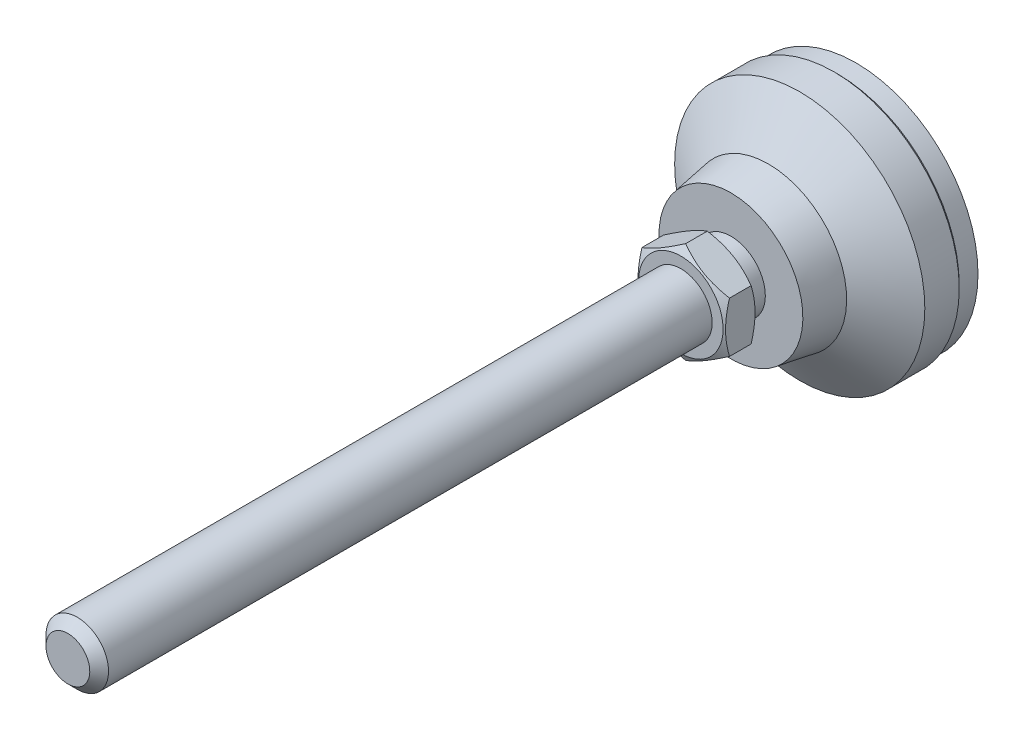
ISO-10303-21;
HEADER;
FILE_DESCRIPTION(('STEP AP214'),'2;1');
FILE_NAME('part.step','',(''),(''),'','','');
FILE_SCHEMA(('AUTOMOTIVE_DESIGN { 1 0 10303 214 1 1 1 1 }'));
ENDSEC;
DATA;
#1=APPLICATION_CONTEXT('core data for automotive mechanical design processes');
#2=APPLICATION_PROTOCOL_DEFINITION('international standard','automotive_design',2000,#1);
#3=PRODUCT_CONTEXT('',#1,'mechanical');
#4=PRODUCT('Part','Part','',(#3));
#5=PRODUCT_RELATED_PRODUCT_CATEGORY('part','',(#4));
#6=PRODUCT_DEFINITION_FORMATION('','',#4);
#7=PRODUCT_DEFINITION_CONTEXT('part definition',#1,'design');
#8=PRODUCT_DEFINITION('design','',#6,#7);
#9=PRODUCT_DEFINITION_SHAPE('','',#8);
#10=(LENGTH_UNIT() NAMED_UNIT(*) SI_UNIT(.MILLI.,.METRE.));
#11=(NAMED_UNIT(*) PLANE_ANGLE_UNIT() SI_UNIT($,.RADIAN.));
#12=(NAMED_UNIT(*) SI_UNIT($,.STERADIAN.) SOLID_ANGLE_UNIT());
#13=UNCERTAINTY_MEASURE_WITH_UNIT(LENGTH_MEASURE(1.E-05),#10,'distance_accuracy_value','');
#14=(GEOMETRIC_REPRESENTATION_CONTEXT(3) GLOBAL_UNCERTAINTY_ASSIGNED_CONTEXT((#13)) GLOBAL_UNIT_ASSIGNED_CONTEXT((#10,
#11,#12)) REPRESENTATION_CONTEXT('',''));
#15=CARTESIAN_POINT('',(0.,0.,0.));
#16=DIRECTION('',(0.,0.,1.));
#17=DIRECTION('',(1.,0.,0.));
#18=AXIS2_PLACEMENT_3D('',#15,#16,#17);
#19=CARTESIAN_POINT('',(0.,0.,1.99999999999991));
#20=DIRECTION('',(0.,0.,-1.));
#21=DIRECTION('',(0.,1.,0.));
#22=AXIS2_PLACEMENT_3D('',#19,#20,#21);
#23=CYLINDRICAL_SURFACE('',#22,20.);
#24=CARTESIAN_POINT('',(0.,0.,3.5));
#25=DIRECTION('',(0.,0.,-1.));
#26=DIRECTION('',(0.,1.,0.));
#27=AXIS2_PLACEMENT_3D('',#24,#25,#26);
#28=CIRCLE('',#27,20.);
#29=CARTESIAN_POINT('',(0.,20.,3.5));
#30=VERTEX_POINT('',#29);
#31=EDGE_CURVE('E114',#30,#30,#28,.F.);
#32=ORIENTED_EDGE('',*,*,#31,.T.);
#33=EDGE_LOOP('',(#32));
#34=FACE_BOUND('',#33,.T.);
#35=CARTESIAN_POINT('',(0.,0.,9.));
#36=DIRECTION('',(0.,0.,-1.));
#37=DIRECTION('',(0.,1.,0.));
#38=AXIS2_PLACEMENT_3D('',#35,#36,#37);
#39=CIRCLE('',#38,20.);
#40=CARTESIAN_POINT('',(0.,20.,9.));
#41=VERTEX_POINT('',#40);
#42=EDGE_CURVE('E108',#41,#41,#39,.T.);
#43=ORIENTED_EDGE('',*,*,#42,.T.);
#44=EDGE_LOOP('',(#43));
#45=FACE_BOUND('',#44,.T.);
#46=ADVANCED_FACE('F14',(#34,#45),#23,.T.);
#47=CARTESIAN_POINT('',(0.,0.,14.));
#48=DIRECTION('',(0.,0.,-1.));
#49=DIRECTION('',(0.,1.,0.));
#50=AXIS2_PLACEMENT_3D('',#47,#48,#49);
#51=CONICAL_SURFACE('',#50,12.5,0.98279372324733);
#52=ORIENTED_EDGE('',*,*,#42,.F.);
#53=EDGE_LOOP('',(#52));
#54=FACE_BOUND('',#53,.T.);
#55=CARTESIAN_POINT('',(0.,0.,14.));
#56=DIRECTION('',(0.,0.,-1.));
#57=DIRECTION('',(0.,1.,0.));
#58=AXIS2_PLACEMENT_3D('',#55,#56,#57);
#59=CIRCLE('',#58,12.5);
#60=CARTESIAN_POINT('',(0.,12.5,14.));
#61=VERTEX_POINT('',#60);
#62=EDGE_CURVE('E105',#61,#61,#59,.T.);
#63=ORIENTED_EDGE('',*,*,#62,.T.);
#64=EDGE_LOOP('',(#63));
#65=FACE_BOUND('',#64,.T.);
#66=ADVANCED_FACE('F226',(#54,#65),#51,.T.);
#67=CARTESIAN_POINT('',(0.,0.,20.));
#68=DIRECTION('',(0.,0.,-1.));
#69=DIRECTION('',(0.,1.,0.));
#70=AXIS2_PLACEMENT_3D('',#67,#68,#69);
#71=CONICAL_SURFACE('',#70,11.5,0.165148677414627);
#72=ORIENTED_EDGE('',*,*,#62,.F.);
#73=EDGE_LOOP('',(#72));
#74=FACE_BOUND('',#73,.T.);
#75=CARTESIAN_POINT('',(0.,0.,20.));
#76=DIRECTION('',(0.,0.,-1.));
#77=DIRECTION('',(0.,1.,0.));
#78=AXIS2_PLACEMENT_3D('',#75,#76,#77);
#79=CIRCLE('',#78,11.5);
#80=CARTESIAN_POINT('',(0.,11.5,20.));
#81=VERTEX_POINT('',#80);
#82=EDGE_CURVE('E102',#81,#81,#79,.T.);
#83=ORIENTED_EDGE('',*,*,#82,.T.);
#84=EDGE_LOOP('',(#83));
#85=FACE_BOUND('',#84,.T.);
#86=ADVANCED_FACE('F222',(#74,#85),#71,.T.);
#87=CARTESIAN_POINT('',(-11.5,0.,20.));
#88=DIRECTION('',(0.,0.,-1.));
#89=DIRECTION('',(0.,1.,0.));
#90=AXIS2_PLACEMENT_3D('',#87,#88,#89);
#91=PLANE('',#90);
#92=ORIENTED_EDGE('',*,*,#82,.F.);
#93=EDGE_LOOP('',(#92));
#94=FACE_BOUND('',#93,.T.);
#95=CARTESIAN_POINT('',(0.,0.,20.));
#96=DIRECTION('',(0.,0.,-1.));
#97=DIRECTION('',(0.,1.,0.));
#98=AXIS2_PLACEMENT_3D('',#95,#96,#97);
#99=CIRCLE('',#98,5.49999999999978);
#100=CARTESIAN_POINT('',(0.,5.49999999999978,20.));
#101=VERTEX_POINT('',#100);
#102=EDGE_CURVE('E99',#101,#101,#99,.T.);
#103=ORIENTED_EDGE('',*,*,#102,.T.);
#104=EDGE_LOOP('',(#103));
#105=FACE_BOUND('',#104,.T.);
#106=ADVANCED_FACE('F218',(#94,#105),#91,.F.);
#107=CARTESIAN_POINT('',(0.,0.,1.99999999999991));
#108=DIRECTION('',(0.,0.,-1.));
#109=DIRECTION('',(0.,1.,0.));
#110=AXIS2_PLACEMENT_3D('',#107,#108,#109);
#111=CYLINDRICAL_SURFACE('',#110,5.49999999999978);
#112=ORIENTED_EDGE('',*,*,#102,.F.);
#113=EDGE_LOOP('',(#112));
#114=FACE_BOUND('',#113,.T.);
#115=CARTESIAN_POINT('',(0.,0.,23.));
#116=DIRECTION('',(0.,0.,-1.));
#117=DIRECTION('',(0.,1.,0.));
#118=AXIS2_PLACEMENT_3D('',#115,#116,#117);
#119=CIRCLE('',#118,5.49999999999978);
#120=CARTESIAN_POINT('',(0.,5.49999999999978,23.));
#121=VERTEX_POINT('',#120);
#122=EDGE_CURVE('E96',#121,#121,#119,.T.);
#123=ORIENTED_EDGE('',*,*,#122,.T.);
#124=EDGE_LOOP('',(#123));
#125=FACE_BOUND('',#124,.T.);
#126=ADVANCED_FACE('F214',(#114,#125),#111,.T.);
#127=CARTESIAN_POINT('',(-5.49999999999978,0.,23.));
#128=DIRECTION('',(0.,0.,1.));
#129=DIRECTION('',(0.,-1.,0.));
#130=AXIS2_PLACEMENT_3D('',#127,#128,#129);
#131=PLANE('',#130);
#132=CARTESIAN_POINT('',(0.,0.,23.));
#133=DIRECTION('',(0.,0.,1.));
#134=DIRECTION('',(0.,-1.,0.));
#135=AXIS2_PLACEMENT_3D('',#132,#133,#134);
#136=CIRCLE('',#135,6.75);
#137=CARTESIAN_POINT('',(0.,-6.75,23.));
#138=VERTEX_POINT('',#137);
#139=EDGE_CURVE('E305',#138,#138,#136,.T.);
#140=ORIENTED_EDGE('',*,*,#139,.F.);
#141=EDGE_LOOP('',(#140));
#142=FACE_BOUND('',#141,.T.);
#143=ORIENTED_EDGE('',*,*,#122,.F.);
#144=EDGE_LOOP('',(#143));
#145=FACE_BOUND('',#144,.T.);
#146=ADVANCED_FACE('F211',(#142,#145),#131,.F.);
#147=CARTESIAN_POINT('',(0.,0.,3.));
#148=DIRECTION('',(0.,0.,1.));
#149=DIRECTION('',(0.,-1.,0.));
#150=AXIS2_PLACEMENT_3D('',#147,#148,#149);
#151=CONICAL_SURFACE('',#150,19.5,0.785398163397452);
#152=ORIENTED_EDGE('',*,*,#31,.F.);
#153=EDGE_LOOP('',(#152));
#154=FACE_BOUND('',#153,.T.);
#155=CARTESIAN_POINT('',(0.,0.,3.));
#156=DIRECTION('',(0.,0.,-1.));
#157=DIRECTION('',(0.,1.,0.));
#158=AXIS2_PLACEMENT_3D('',#155,#156,#157);
#159=CIRCLE('',#158,19.5);
#160=CARTESIAN_POINT('',(0.,19.5,3.));
#161=VERTEX_POINT('',#160);
#162=EDGE_CURVE('E111',#161,#161,#159,.T.);
#163=ORIENTED_EDGE('',*,*,#162,.F.);
#164=EDGE_LOOP('',(#163));
#165=FACE_BOUND('',#164,.T.);
#166=ADVANCED_FACE('F16',(#154,#165),#151,.T.);
#167=CARTESIAN_POINT('',(0.,0.,0.));
#168=DIRECTION('',(0.,0.,1.));
#169=DIRECTION('',(0.,-1.,0.));
#170=AXIS2_PLACEMENT_3D('',#167,#168,#169);
#171=CYLINDRICAL_SURFACE('',#170,19.5);
#172=CARTESIAN_POINT('',(0.,0.,0.));
#173=DIRECTION('',(0.,0.,-1.));
#174=DIRECTION('',(0.,1.,0.));
#175=AXIS2_PLACEMENT_3D('',#172,#173,#174);
#176=CIRCLE('',#175,19.5);
#177=CARTESIAN_POINT('',(0.,19.5,0.));
#178=VERTEX_POINT('',#177);
#179=EDGE_CURVE('E278',#178,#178,#176,.T.);
#180=ORIENTED_EDGE('',*,*,#179,.F.);
#181=EDGE_LOOP('',(#180));
#182=FACE_BOUND('',#181,.T.);
#183=ORIENTED_EDGE('',*,*,#162,.T.);
#184=EDGE_LOOP('',(#183));
#185=FACE_BOUND('',#184,.T.);
#186=ADVANCED_FACE('F251',(#182,#185),#171,.T.);
#187=CARTESIAN_POINT('',(0.,0.,0.));
#188=DIRECTION('',(0.,0.,-1.));
#189=DIRECTION('',(0.,1.,0.));
#190=AXIS2_PLACEMENT_3D('',#187,#188,#189);
#191=PLANE('',#190);
#192=ORIENTED_EDGE('',*,*,#179,.T.);
#193=EDGE_LOOP('',(#192));
#194=FACE_BOUND('',#193,.T.);
#195=ADVANCED_FACE('F134',(#194),#191,.T.);
#196=CARTESIAN_POINT('',(0.,0.,23.));
#197=DIRECTION('',(0.,0.,1.));
#198=DIRECTION('',(0.,-1.,0.));
#199=AXIS2_PLACEMENT_3D('',#196,#197,#198);
#200=CONICAL_SURFACE('',#199,6.75,1.0471975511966);
#201=CARTESIAN_POINT('',(0.000200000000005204,-8.08301923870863,23.7696190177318));
#202=CARTESIAN_POINT('',(-0.153667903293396,-7.99418356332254,23.7183374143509));
#203=CARTESIAN_POINT('',(-0.308109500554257,-7.90501666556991,23.669383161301));
#204=CARTESIAN_POINT('',(-0.618246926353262,-7.72595873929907,23.5767703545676));
#205=CARTESIAN_POINT('',(-0.773943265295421,-7.63606741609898,23.5331140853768));
#206=CARTESIAN_POINT('',(-1.24352516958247,-7.36495417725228,23.4109491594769));
#207=CARTESIAN_POINT('',(-1.55926433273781,-7.18266208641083,23.3414631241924));
#208=CARTESIAN_POINT('',(-2.03176224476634,-6.90986528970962,23.2599825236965));
#209=CARTESIAN_POINT('',(-2.1871092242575,-6.82017566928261,23.2367710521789));
#210=CARTESIAN_POINT('',(-2.49850511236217,-6.64039116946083,23.1978487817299));
#211=CARTESIAN_POINT('',(-2.65455395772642,-6.55029632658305,23.1821373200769));
#212=CARTESIAN_POINT('',(-2.96692267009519,-6.36995016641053,23.1586154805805));
#213=CARTESIAN_POINT('',(-3.12324202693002,-6.27969914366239,23.1507961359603));
#214=CARTESIAN_POINT('',(-3.43601650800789,-6.09911871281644,23.1432178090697));
#215=CARTESIAN_POINT('',(-3.59247162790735,-6.00878930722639,23.1434585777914));
#216=CARTESIAN_POINT('',(-4.02110687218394,-5.76131663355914,23.1551972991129));
#217=CARTESIAN_POINT('',(-4.2931466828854,-5.60425437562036,23.1749033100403));
#218=CARTESIAN_POINT('',(-4.83541944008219,-5.29117305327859,23.2373910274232));
#219=CARTESIAN_POINT('',(-5.10565047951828,-5.13515508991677,23.2801940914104));
#220=CARTESIAN_POINT('',(-5.64901454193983,-4.82144370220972,23.3871892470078));
#221=CARTESIAN_POINT('',(-5.92207900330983,-4.66378986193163,23.4518346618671));
#222=CARTESIAN_POINT('',(-6.46413578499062,-4.35083323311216,23.5985536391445));
#223=CARTESIAN_POINT('',(-6.73313504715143,-4.19552643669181,23.680592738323));
#224=CARTESIAN_POINT('',(-7.0002,-4.04133641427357,23.7696190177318));
#225=B_SPLINE_CURVE_WITH_KNOTS('',3,(#201,#202,#203,#204,#205,#206,#207,#208,#209,#210,#211,
#212,#213,#214,#215,#216,#217,#218,#219,#220,#221,#222,#223,#224),.UNSPECIFIED.,.F.,.F.,(4,2,2,
2,2,2,2,2,2,2,2,4),(0.,0.554727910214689,1.10969417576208,2.2219327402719,2.76443041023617,
3.30688013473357,3.8487128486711,4.39052882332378,5.33376515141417,6.27787517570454,
7.24292418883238,8.20607866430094),.UNSPECIFIED.);
#226=CARTESIAN_POINT('',(0.,-8.08290376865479,23.7695523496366));
#227=VERTEX_POINT('',#226);
#228=CARTESIAN_POINT('',(-7.,-4.04145188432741,23.7695523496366));
#229=VERTEX_POINT('',#228);
#230=EDGE_CURVE('E73',#227,#229,#225,.T.);
#231=ORIENTED_EDGE('',*,*,#230,.T.);
#232=CARTESIAN_POINT('',(-7.,10.8744224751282,26.5695463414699));
#233=CARTESIAN_POINT('',(-7.,10.5685293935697,26.4210861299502));
#234=CARTESIAN_POINT('',(-7.,10.2619361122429,26.2740440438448));
#235=CARTESIAN_POINT('',(-7.,9.64697684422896,25.9835933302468));
#236=CARTESIAN_POINT('',(-7.,9.33861058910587,25.8401852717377));
#237=CARTESIAN_POINT('',(-7.,8.71815320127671,25.5570823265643));
#238=CARTESIAN_POINT('',(-7.,8.40605094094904,25.4174117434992));
#239=CARTESIAN_POINT('',(-7.,7.77937061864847,25.1437615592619));
#240=CARTESIAN_POINT('',(-7.,7.46479267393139,25.0097816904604));
#241=CARTESIAN_POINT('',(-7.,6.82243612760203,24.7447970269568));
#242=CARTESIAN_POINT('',(-7.,6.49455954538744,24.6140284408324));
#243=CARTESIAN_POINT('',(-7.,5.83497811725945,24.3623433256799));
#244=CARTESIAN_POINT('',(-7.,5.50327284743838,24.241427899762));
#245=CARTESIAN_POINT('',(-7.,4.83611715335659,24.0126100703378));
#246=CARTESIAN_POINT('',(-7.,4.50067580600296,23.9046814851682));
#247=CARTESIAN_POINT('',(-7.,3.82499332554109,23.7052869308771));
#248=CARTESIAN_POINT('',(-7.,3.48475373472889,23.6138157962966));
#249=CARTESIAN_POINT('',(-7.,2.80111690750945,23.4522069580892));
#250=CARTESIAN_POINT('',(-7.,2.45774793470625,23.3819529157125));
#251=CARTESIAN_POINT('',(-7.,1.9395523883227,23.2955166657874));
#252=CARTESIAN_POINT('',(-7.,1.76628408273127,23.269860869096));
#253=CARTESIAN_POINT('',(-7.,1.41888071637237,23.2253671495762));
#254=CARTESIAN_POINT('',(-7.,1.2447457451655,23.2065285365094));
#255=CARTESIAN_POINT('',(-7.,0.898124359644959,23.1762815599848));
#256=CARTESIAN_POINT('',(-7.,0.725646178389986,23.1647792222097));
#257=CARTESIAN_POINT('',(-7.,0.380357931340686,23.1490795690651));
#258=CARTESIAN_POINT('',(-7.,0.20754787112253,23.1448821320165));
#259=CARTESIAN_POINT('',(-7.,-0.138095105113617,23.1438924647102));
#260=CARTESIAN_POINT('',(-7.,-0.310928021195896,23.1471002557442));
#261=CARTESIAN_POINT('',(-7.,-0.656304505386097,23.1608423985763));
#262=CARTESIAN_POINT('',(-7.,-0.828848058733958,23.1713771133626));
#263=CARTESIAN_POINT('',(-7.,-1.24295519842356,23.2052297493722));
#264=CARTESIAN_POINT('',(-7.,-1.48424316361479,23.2319925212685));
#265=CARTESIAN_POINT('',(-7.,-1.96502916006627,23.2983905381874));
#266=CARTESIAN_POINT('',(-7.,-2.20452694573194,23.3380275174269));
#267=CARTESIAN_POINT('',(-7.,-2.92006051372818,23.4741481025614));
#268=CARTESIAN_POINT('',(-7.,-3.3928703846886,23.5878167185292));
#269=CARTESIAN_POINT('',(-7.,-4.09987706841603,23.7849469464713));
#270=CARTESIAN_POINT('',(-7.,-4.33774042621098,23.8560149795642));
#271=CARTESIAN_POINT('',(-7.,-4.81115690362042,24.0055374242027));
#272=CARTESIAN_POINT('',(-7.,-5.04671000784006,24.0839918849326));
#273=CARTESIAN_POINT('',(-7.,-5.51558001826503,24.2470279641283));
#274=CARTESIAN_POINT('',(-7.,-5.74889763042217,24.3316075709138));
#275=CARTESIAN_POINT('',(-7.,-6.21359932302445,24.5058982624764));
#276=CARTESIAN_POINT('',(-7.,-6.44498342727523,24.5956092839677));
#277=CARTESIAN_POINT('',(-7.,-6.99564532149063,24.8150159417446));
#278=CARTESIAN_POINT('',(-7.,-7.31412949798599,24.9466998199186));
#279=CARTESIAN_POINT('',(-7.,-7.94835141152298,25.216542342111));
#280=CARTESIAN_POINT('',(-7.,-8.26408897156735,25.3547013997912));
#281=CARTESIAN_POINT('',(-7.,-8.89332991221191,25.6361787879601));
#282=CARTESIAN_POINT('',(-7.,-9.2068328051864,25.7794982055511));
#283=CARTESIAN_POINT('',(-7.,-9.83192836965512,26.07025140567));
#284=CARTESIAN_POINT('',(-7.,-10.1435209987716,26.217685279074));
#285=CARTESIAN_POINT('',(-7.,-10.765449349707,26.5160481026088));
#286=CARTESIAN_POINT('',(-7.,-11.0757833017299,26.6669807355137));
#287=CARTESIAN_POINT('',(-7.,-11.6951055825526,26.9715845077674));
#288=CARTESIAN_POINT('',(-7.,-12.0040938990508,27.1252556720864));
#289=CARTESIAN_POINT('',(-7.,-12.9292795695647,27.5895982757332));
#290=CARTESIAN_POINT('',(-7.,-13.543784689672,27.9036409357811));
#291=CARTESIAN_POINT('',(-7.,-14.7172311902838,28.5109598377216));
#292=CARTESIAN_POINT('',(-7.,-15.2764399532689,28.8037217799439));
#293=CARTESIAN_POINT('',(-7.,-16.392787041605,29.393213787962));
#294=CARTESIAN_POINT('',(-7.,-16.9499252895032,29.6899440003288));
#295=CARTESIAN_POINT('',(-7.,-18.0611636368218,30.2856562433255));
#296=CARTESIAN_POINT('',(-7.,-18.6152678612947,30.5846305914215));
#297=CARTESIAN_POINT('',(-7.,-19.7221554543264,31.1849408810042));
#298=CARTESIAN_POINT('',(-7.,-20.2749388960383,31.4862766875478));
#299=CARTESIAN_POINT('',(-7.,-20.8272377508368,31.7884921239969));
#300=B_SPLINE_CURVE_WITH_KNOTS('',3,(#232,#233,#234,#235,#236,#237,#238,#239,#240,#241,#242,
#243,#244,#245,#246,#247,#248,#249,#250,#251,#252,#253,#254,#255,#256,#257,#258,#259,#260,#261,
#262,#263,#264,#265,#266,#267,#268,#269,#270,#271,#272,#273,#274,#275,#276,#277,#278,#279,#280,
#281,#282,#283,#284,#285,#286,#287,#288,#289,#290,#291,#292,#293,#294,#295,#296,#297,#298,#299),
.UNSPECIFIED.,.F.,.F.,(4,2,2,2,2,2,2,2,2,2,2,2,2,2,2,2,2,2,2,2,2,2,2,2,2,2,2,2,2,2,2,2,2,4),(0.,
1.0200609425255,2.04028062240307,3.06602318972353,4.09171746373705,5.15057109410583,
6.20954310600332,7.26634311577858,8.32281084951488,9.37337588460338,9.89873518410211,
10.424041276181,10.9424756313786,11.4609013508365,11.9793285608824,12.4977814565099,
13.2256734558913,13.9536635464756,15.4104419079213,16.1551391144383,16.8998412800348,
17.6442999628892,18.3887494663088,19.4225551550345,20.4564269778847,21.4905178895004,
22.5246316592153,23.5598883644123,24.5951545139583,26.6653967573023,28.5590049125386,
30.4526832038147,32.341527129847,34.2302638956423),.UNSPECIFIED.);
#301=CARTESIAN_POINT('',(-7.,4.04145188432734,23.7695523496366));
#302=VERTEX_POINT('',#301);
#303=EDGE_CURVE('E81',#229,#302,#300,.F.);
#304=ORIENTED_EDGE('',*,*,#303,.T.);
#305=CARTESIAN_POINT('',(-7.0002,4.0413364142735,23.7696190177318));
#306=CARTESIAN_POINT('',(-6.8463320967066,4.13017208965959,23.7183374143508));
#307=CARTESIAN_POINT('',(-6.69189049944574,4.21933898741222,23.669383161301));
#308=CARTESIAN_POINT('',(-6.38175307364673,4.39839691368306,23.5767703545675));
#309=CARTESIAN_POINT('',(-6.22605673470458,4.48828823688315,23.5331140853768));
#310=CARTESIAN_POINT('',(-5.75647483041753,4.75940147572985,23.4109491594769));
#311=CARTESIAN_POINT('',(-5.4407356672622,4.94169356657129,23.3414631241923));
#312=CARTESIAN_POINT('',(-4.96823775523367,5.2144903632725,23.2599825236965));
#313=CARTESIAN_POINT('',(-4.81289077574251,5.30417998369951,23.2367710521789));
#314=CARTESIAN_POINT('',(-4.50149488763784,5.48396448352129,23.1978487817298));
#315=CARTESIAN_POINT('',(-4.34544604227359,5.57405932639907,23.1821373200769));
#316=CARTESIAN_POINT('',(-4.03307732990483,5.75440548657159,23.1586154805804));
#317=CARTESIAN_POINT('',(-3.87675797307,5.84465650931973,23.1507961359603));
#318=CARTESIAN_POINT('',(-3.56398349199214,6.02523694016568,23.1432178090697));
#319=CARTESIAN_POINT('',(-3.40752837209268,6.11556634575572,23.1434585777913));
#320=CARTESIAN_POINT('',(-2.97889312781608,6.36303901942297,23.1551972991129));
#321=CARTESIAN_POINT('',(-2.70685331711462,6.52010127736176,23.1749033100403));
#322=CARTESIAN_POINT('',(-2.16458055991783,6.83318259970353,23.2373910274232));
#323=CARTESIAN_POINT('',(-1.89434952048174,6.98920056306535,23.2801940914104));
#324=CARTESIAN_POINT('',(-1.35098545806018,7.3029119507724,23.3871892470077));
#325=CARTESIAN_POINT('',(-1.07792099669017,7.4605657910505,23.4518346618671));
#326=CARTESIAN_POINT('',(-0.535864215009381,7.77352241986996,23.5985536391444));
#327=CARTESIAN_POINT('',(-0.266864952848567,7.92882921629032,23.6805927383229));
#328=CARTESIAN_POINT('',(0.000200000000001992,8.08301923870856,23.7696190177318));
#329=B_SPLINE_CURVE_WITH_KNOTS('',3,(#305,#306,#307,#308,#309,#310,#311,#312,#313,#314,#315,
#316,#317,#318,#319,#320,#321,#322,#323,#324,#325,#326,#327,#328),.UNSPECIFIED.,.F.,.F.,(4,2,2,
2,2,2,2,2,2,2,2,4),(0.,0.554727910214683,1.10969417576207,2.22193274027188,2.76443041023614,
3.30688013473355,3.84871284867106,4.39052882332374,5.33376515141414,6.27787517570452,
7.24292418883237,8.20607866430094),.UNSPECIFIED.);
#330=CARTESIAN_POINT('',(0.,8.08290376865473,23.7695523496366));
#331=VERTEX_POINT('',#330);
#332=EDGE_CURVE('E193',#302,#331,#329,.T.);
#333=ORIENTED_EDGE('',*,*,#332,.T.);
#334=CARTESIAN_POINT('',(-0.000199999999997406,8.08301923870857,23.7696190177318));
#335=CARTESIAN_POINT('',(0.153667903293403,7.99418356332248,23.7183374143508));
#336=CARTESIAN_POINT('',(0.308109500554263,7.90501666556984,23.669383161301));
#337=CARTESIAN_POINT('',(0.618246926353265,7.72595873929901,23.5767703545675));
#338=CARTESIAN_POINT('',(0.773943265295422,7.63606741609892,23.5331140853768));
#339=CARTESIAN_POINT('',(1.24352516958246,7.36495417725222,23.4109491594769));
#340=CARTESIAN_POINT('',(1.5592643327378,7.18266208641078,23.3414631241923));
#341=CARTESIAN_POINT('',(2.03176224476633,6.90986528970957,23.2599825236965));
#342=CARTESIAN_POINT('',(2.18710922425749,6.82017566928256,23.2367710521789));
#343=CARTESIAN_POINT('',(2.49850511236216,6.64039116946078,23.1978487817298));
#344=CARTESIAN_POINT('',(2.65455395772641,6.550296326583,23.1821373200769));
#345=CARTESIAN_POINT('',(2.96692267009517,6.36995016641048,23.1586154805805));
#346=CARTESIAN_POINT('',(3.12324202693,6.27969914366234,23.1507961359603));
#347=CARTESIAN_POINT('',(3.43601650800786,6.09911871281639,23.1432178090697));
#348=CARTESIAN_POINT('',(3.59247162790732,6.00878930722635,23.1434585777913));
#349=CARTESIAN_POINT('',(4.02110687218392,5.7613166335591,23.1551972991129));
#350=CARTESIAN_POINT('',(4.29314668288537,5.60425437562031,23.1749033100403));
#351=CARTESIAN_POINT('',(4.83541944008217,5.29117305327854,23.2373910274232));
#352=CARTESIAN_POINT('',(5.10565047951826,5.13515508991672,23.2801940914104));
#353=CARTESIAN_POINT('',(5.64901454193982,4.82144370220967,23.3871892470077));
#354=CARTESIAN_POINT('',(5.92207900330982,4.66378986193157,23.4518346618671));
#355=CARTESIAN_POINT('',(6.46413578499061,4.35083323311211,23.5985536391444));
#356=CARTESIAN_POINT('',(6.73313504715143,4.19552643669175,23.6805927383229));
#357=CARTESIAN_POINT('',(7.0002,4.04133641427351,23.7696190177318));
#358=B_SPLINE_CURVE_WITH_KNOTS('',3,(#334,#335,#336,#337,#338,#339,#340,#341,#342,#343,#344,
#345,#346,#347,#348,#349,#350,#351,#352,#353,#354,#355,#356,#357),.UNSPECIFIED.,.F.,.F.,(4,2,2,
2,2,2,2,2,2,2,2,4),(0.,0.554727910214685,1.10969417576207,2.22193274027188,2.76443041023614,
3.30688013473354,3.84871284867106,4.39052882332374,5.33376515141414,6.27787517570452,
7.24292418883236,8.20607866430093),.UNSPECIFIED.);
#359=CARTESIAN_POINT('',(7.,4.04145188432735,23.7695523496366));
#360=VERTEX_POINT('',#359);
#361=EDGE_CURVE('E304',#331,#360,#358,.T.);
#362=ORIENTED_EDGE('',*,*,#361,.T.);
#363=CARTESIAN_POINT('',(7.,10.8744224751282,26.5695463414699));
#364=CARTESIAN_POINT('',(7.,10.5685293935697,26.4210861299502));
#365=CARTESIAN_POINT('',(7.,10.2619361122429,26.2740440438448));
#366=CARTESIAN_POINT('',(7.,9.64697684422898,25.9835933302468));
#367=CARTESIAN_POINT('',(7.,9.33861058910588,25.8401852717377));
#368=CARTESIAN_POINT('',(7.,8.71815320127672,25.5570823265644));
#369=CARTESIAN_POINT('',(7.,8.40605094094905,25.4174117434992));
#370=CARTESIAN_POINT('',(7.,7.77937061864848,25.1437615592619));
#371=CARTESIAN_POINT('',(7.,7.4647926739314,25.0097816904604));
#372=CARTESIAN_POINT('',(7.,6.82243612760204,24.7447970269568));
#373=CARTESIAN_POINT('',(7.,6.49455954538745,24.6140284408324));
#374=CARTESIAN_POINT('',(7.,5.83497811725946,24.3623433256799));
#375=CARTESIAN_POINT('',(7.,5.50327284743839,24.241427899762));
#376=CARTESIAN_POINT('',(7.,4.8361171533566,24.0126100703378));
#377=CARTESIAN_POINT('',(7.,4.50067580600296,23.9046814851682));
#378=CARTESIAN_POINT('',(7.,3.82499332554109,23.7052869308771));
#379=CARTESIAN_POINT('',(7.,3.48475373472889,23.6138157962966));
#380=CARTESIAN_POINT('',(7.,2.80111690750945,23.4522069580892));
#381=CARTESIAN_POINT('',(7.,2.45774793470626,23.3819529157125));
#382=CARTESIAN_POINT('',(7.,1.9395523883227,23.2955166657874));
#383=CARTESIAN_POINT('',(7.,1.76628408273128,23.269860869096));
#384=CARTESIAN_POINT('',(7.,1.41888071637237,23.2253671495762));
#385=CARTESIAN_POINT('',(7.,1.24474574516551,23.2065285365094));
#386=CARTESIAN_POINT('',(7.,0.898124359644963,23.1762815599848));
#387=CARTESIAN_POINT('',(7.,0.72564617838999,23.1647792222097));
#388=CARTESIAN_POINT('',(7.,0.380357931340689,23.1490795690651));
#389=CARTESIAN_POINT('',(7.,0.207547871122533,23.1448821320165));
#390=CARTESIAN_POINT('',(7.,-0.138095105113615,23.1438924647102));
#391=CARTESIAN_POINT('',(7.,-0.310928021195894,23.1471002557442));
#392=CARTESIAN_POINT('',(7.,-0.656304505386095,23.1608423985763));
#393=CARTESIAN_POINT('',(7.,-0.828848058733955,23.1713771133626));
#394=CARTESIAN_POINT('',(7.,-1.24295519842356,23.2052297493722));
#395=CARTESIAN_POINT('',(7.,-1.48424316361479,23.2319925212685));
#396=CARTESIAN_POINT('',(7.,-1.96502916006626,23.2983905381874));
#397=CARTESIAN_POINT('',(7.,-2.20452694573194,23.3380275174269));
#398=CARTESIAN_POINT('',(7.,-2.92006051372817,23.4741481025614));
#399=CARTESIAN_POINT('',(7.,-3.3928703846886,23.5878167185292));
#400=CARTESIAN_POINT('',(7.,-4.09987706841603,23.7849469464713));
#401=CARTESIAN_POINT('',(7.,-4.33774042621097,23.8560149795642));
#402=CARTESIAN_POINT('',(7.,-4.81115690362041,24.0055374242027));
#403=CARTESIAN_POINT('',(7.,-5.04671000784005,24.0839918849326));
#404=CARTESIAN_POINT('',(7.,-5.51558001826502,24.2470279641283));
#405=CARTESIAN_POINT('',(7.,-5.74889763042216,24.3316075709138));
#406=CARTESIAN_POINT('',(7.,-6.21359932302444,24.5058982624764));
#407=CARTESIAN_POINT('',(7.,-6.44498342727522,24.5956092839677));
#408=CARTESIAN_POINT('',(7.,-6.99564532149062,24.8150159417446));
#409=CARTESIAN_POINT('',(7.,-7.31412949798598,24.9466998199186));
#410=CARTESIAN_POINT('',(7.,-7.94835141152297,25.216542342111));
#411=CARTESIAN_POINT('',(7.,-8.26408897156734,25.3547013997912));
#412=CARTESIAN_POINT('',(7.,-8.8933299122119,25.6361787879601));
#413=CARTESIAN_POINT('',(7.,-9.2068328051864,25.7794982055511));
#414=CARTESIAN_POINT('',(7.,-9.83192836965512,26.07025140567));
#415=CARTESIAN_POINT('',(7.,-10.1435209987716,26.217685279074));
#416=CARTESIAN_POINT('',(7.,-10.765449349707,26.5160481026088));
#417=CARTESIAN_POINT('',(7.,-11.0757833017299,26.6669807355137));
#418=CARTESIAN_POINT('',(7.,-11.6951055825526,26.9715845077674));
#419=CARTESIAN_POINT('',(7.,-12.0040938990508,27.1252556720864));
#420=CARTESIAN_POINT('',(7.,-12.9292795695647,27.5895982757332));
#421=CARTESIAN_POINT('',(7.,-13.543784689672,27.9036409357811));
#422=CARTESIAN_POINT('',(7.,-14.7172311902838,28.5109598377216));
#423=CARTESIAN_POINT('',(7.,-15.2764399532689,28.8037217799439));
#424=CARTESIAN_POINT('',(7.,-16.392787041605,29.3932137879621));
#425=CARTESIAN_POINT('',(7.,-16.9499252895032,29.6899440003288));
#426=CARTESIAN_POINT('',(7.,-18.0611636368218,30.2856562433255));
#427=CARTESIAN_POINT('',(7.,-18.6152678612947,30.5846305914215));
#428=CARTESIAN_POINT('',(7.,-19.7221554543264,31.1849408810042));
#429=CARTESIAN_POINT('',(7.,-20.2749388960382,31.4862766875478));
#430=CARTESIAN_POINT('',(7.,-20.8272377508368,31.7884921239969));
#431=B_SPLINE_CURVE_WITH_KNOTS('',3,(#363,#364,#365,#366,#367,#368,#369,#370,#371,#372,#373,
#374,#375,#376,#377,#378,#379,#380,#381,#382,#383,#384,#385,#386,#387,#388,#389,#390,#391,#392,
#393,#394,#395,#396,#397,#398,#399,#400,#401,#402,#403,#404,#405,#406,#407,#408,#409,#410,#411,
#412,#413,#414,#415,#416,#417,#418,#419,#420,#421,#422,#423,#424,#425,#426,#427,#428,#429,#430),
.UNSPECIFIED.,.F.,.F.,(4,2,2,2,2,2,2,2,2,2,2,2,2,2,2,2,2,2,2,2,2,2,2,2,2,2,2,2,2,2,2,2,2,4),(0.,
1.0200609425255,2.04028062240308,3.06602318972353,4.09171746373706,5.15057109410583,
6.20954310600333,7.26634311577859,8.32281084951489,9.37337588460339,9.89873518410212,
10.4240412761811,10.9424756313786,11.4609013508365,11.9793285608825,12.4977814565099,
13.2256734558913,13.9536635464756,15.4104419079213,16.1551391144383,16.8998412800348,
17.6442999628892,18.3887494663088,19.4225551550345,20.4564269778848,21.4905178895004,
22.5246316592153,23.5598883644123,24.5951545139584,26.6653967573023,28.5590049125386,
30.4526832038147,32.3415271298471,34.2302638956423),.UNSPECIFIED.);
#432=CARTESIAN_POINT('',(7.,-4.04145188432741,23.7695523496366));
#433=VERTEX_POINT('',#432);
#434=EDGE_CURVE('E34',#360,#433,#431,.T.);
#435=ORIENTED_EDGE('',*,*,#434,.T.);
#436=CARTESIAN_POINT('',(7.0002,-4.04133641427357,23.7696190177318));
#437=CARTESIAN_POINT('',(6.8463320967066,-4.13017208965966,23.7183374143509));
#438=CARTESIAN_POINT('',(6.69189049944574,-4.2193389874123,23.669383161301));
#439=CARTESIAN_POINT('',(6.38175307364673,-4.39839691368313,23.5767703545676));
#440=CARTESIAN_POINT('',(6.22605673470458,-4.48828823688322,23.5331140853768));
#441=CARTESIAN_POINT('',(5.75647483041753,-4.75940147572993,23.4109491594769));
#442=CARTESIAN_POINT('',(5.44073566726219,-4.94169356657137,23.3414631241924));
#443=CARTESIAN_POINT('',(4.96823775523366,-5.21449036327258,23.2599825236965));
#444=CARTESIAN_POINT('',(4.8128907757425,-5.30417998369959,23.2367710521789));
#445=CARTESIAN_POINT('',(4.50149488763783,-5.48396448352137,23.1978487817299));
#446=CARTESIAN_POINT('',(4.34544604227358,-5.57405932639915,23.1821373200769));
#447=CARTESIAN_POINT('',(4.03307732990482,-5.75440548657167,23.1586154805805));
#448=CARTESIAN_POINT('',(3.87675797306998,-5.84465650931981,23.1507961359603));
#449=CARTESIAN_POINT('',(3.56398349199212,-6.02523694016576,23.1432178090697));
#450=CARTESIAN_POINT('',(3.40752837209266,-6.11556634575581,23.1434585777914));
#451=CARTESIAN_POINT('',(2.97889312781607,-6.36303901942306,23.1551972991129));
#452=CARTESIAN_POINT('',(2.70685331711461,-6.52010127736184,23.1749033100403));
#453=CARTESIAN_POINT('',(2.16458055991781,-6.83318259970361,23.2373910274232));
#454=CARTESIAN_POINT('',(1.89434952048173,-6.98920056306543,23.2801940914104));
#455=CARTESIAN_POINT('',(1.35098545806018,-7.30291195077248,23.3871892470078));
#456=CARTESIAN_POINT('',(1.07792099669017,-7.46056579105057,23.4518346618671));
#457=CARTESIAN_POINT('',(0.535864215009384,-7.77352241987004,23.5985536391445));
#458=CARTESIAN_POINT('',(0.266864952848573,-7.92882921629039,23.680592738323));
#459=CARTESIAN_POINT('',(-0.000199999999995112,-8.08301923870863,23.7696190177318));
#460=B_SPLINE_CURVE_WITH_KNOTS('',3,(#436,#437,#438,#439,#440,#441,#442,#443,#444,#445,#446,
#447,#448,#449,#450,#451,#452,#453,#454,#455,#456,#457,#458,#459),.UNSPECIFIED.,.F.,.F.,(4,2,2,
2,2,2,2,2,2,2,2,4),(0.,0.554727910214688,1.10969417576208,2.22193274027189,2.76443041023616,
3.30688013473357,3.84871284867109,4.39052882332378,5.33376515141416,6.27787517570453,
7.24292418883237,8.20607866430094),.UNSPECIFIED.);
#461=EDGE_CURVE('E9',#433,#227,#460,.T.);
#462=ORIENTED_EDGE('',*,*,#461,.T.);
#463=EDGE_LOOP('',(#231,#304,#333,#362,#435,#462));
#464=FACE_BOUND('',#463,.T.);
#465=ORIENTED_EDGE('',*,*,#139,.T.);
#466=EDGE_LOOP('',(#465));
#467=FACE_BOUND('',#466,.T.);
#468=ADVANCED_FACE('F71',(#464,#467),#200,.T.);
#469=CARTESIAN_POINT('',(0.,0.,126.));
#470=DIRECTION('',(0.,0.,-1.));
#471=DIRECTION('',(0.,1.,0.));
#472=AXIS2_PLACEMENT_3D('',#469,#470,#471);
#473=PLANE('',#472);
#474=CARTESIAN_POINT('',(0.,0.,126.));
#475=DIRECTION('',(0.,0.,-1.));
#476=DIRECTION('',(0.,1.,0.));
#477=AXIS2_PLACEMENT_3D('',#474,#475,#476);
#478=CIRCLE('',#477,3.5);
#479=CARTESIAN_POINT('',(0.,3.5,126.));
#480=VERTEX_POINT('',#479);
#481=EDGE_CURVE('E87',#480,#480,#478,.T.);
#482=ORIENTED_EDGE('',*,*,#481,.F.);
#483=EDGE_LOOP('',(#482));
#484=FACE_BOUND('',#483,.T.);
#485=ADVANCED_FACE('F183',(#484),#473,.F.);
#486=CARTESIAN_POINT('',(0.,0.,126.));
#487=DIRECTION('',(0.,0.,-1.));
#488=DIRECTION('',(0.,1.,0.));
#489=AXIS2_PLACEMENT_3D('',#486,#487,#488);
#490=CONICAL_SURFACE('',#489,3.5,0.785398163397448);
#491=CARTESIAN_POINT('',(0.,0.,124.5));
#492=DIRECTION('',(0.,0.,-1.));
#493=DIRECTION('',(0.,1.,0.));
#494=AXIS2_PLACEMENT_3D('',#491,#492,#493);
#495=CIRCLE('',#494,5.);
#496=CARTESIAN_POINT('',(0.,5.,124.5));
#497=VERTEX_POINT('',#496);
#498=EDGE_CURVE('E92',#497,#497,#495,.T.);
#499=ORIENTED_EDGE('',*,*,#498,.F.);
#500=EDGE_LOOP('',(#499));
#501=FACE_BOUND('',#500,.T.);
#502=ORIENTED_EDGE('',*,*,#481,.T.);
#503=EDGE_LOOP('',(#502));
#504=FACE_BOUND('',#503,.T.);
#505=ADVANCED_FACE('F264',(#501,#504),#490,.T.);
#506=CARTESIAN_POINT('',(0.,0.,-4.74975615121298));
#507=DIRECTION('',(0.,0.,-1.));
#508=DIRECTION('',(0.,1.,0.));
#509=AXIS2_PLACEMENT_3D('',#506,#507,#508);
#510=CYLINDRICAL_SURFACE('',#509,5.);
#511=CARTESIAN_POINT('',(0.,0.,28.));
#512=DIRECTION('',(0.,0.,-1.));
#513=DIRECTION('',(0.,1.,0.));
#514=AXIS2_PLACEMENT_3D('',#511,#512,#513);
#515=CIRCLE('',#514,5.);
#516=CARTESIAN_POINT('',(0.,5.,28.));
#517=VERTEX_POINT('',#516);
#518=EDGE_CURVE('E117',#517,#517,#515,.F.);
#519=ORIENTED_EDGE('',*,*,#518,.T.);
#520=EDGE_LOOP('',(#519));
#521=FACE_BOUND('',#520,.T.);
#522=ORIENTED_EDGE('',*,*,#498,.T.);
#523=EDGE_LOOP('',(#522));
#524=FACE_BOUND('',#523,.T.);
#525=ADVANCED_FACE('F209',(#521,#524),#510,.T.);
#526=CARTESIAN_POINT('',(-3.99999999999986,0.,28.));
#527=DIRECTION('',(0.,0.,-1.));
#528=DIRECTION('',(0.,1.,0.));
#529=AXIS2_PLACEMENT_3D('',#526,#527,#528);
#530=PLANE('',#529);
#531=CARTESIAN_POINT('',(0.,0.,28.));
#532=DIRECTION('',(0.,0.,1.));
#533=DIRECTION('',(0.,-1.,0.));
#534=AXIS2_PLACEMENT_3D('',#531,#532,#533);
#535=CIRCLE('',#534,6.75);
#536=CARTESIAN_POINT('',(0.,-6.75,28.));
#537=VERTEX_POINT('',#536);
#538=EDGE_CURVE('E80',#537,#537,#535,.T.);
#539=ORIENTED_EDGE('',*,*,#538,.T.);
#540=EDGE_LOOP('',(#539));
#541=FACE_BOUND('',#540,.T.);
#542=ORIENTED_EDGE('',*,*,#518,.F.);
#543=EDGE_LOOP('',(#542));
#544=FACE_BOUND('',#543,.T.);
#545=ADVANCED_FACE('F131',(#541,#544),#530,.F.);
#546=CARTESIAN_POINT('',(0.,0.,25.9677582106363));
#547=DIRECTION('',(0.,0.,-1.));
#548=DIRECTION('',(0.,1.,0.));
#549=AXIS2_PLACEMENT_3D('',#546,#547,#548);
#550=CONICAL_SURFACE('',#549,10.2699460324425,1.0471975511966);
#551=CARTESIAN_POINT('',(-7.0002,-4.04133641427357,27.230380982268));
#552=CARTESIAN_POINT('',(-6.84633209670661,-4.13017208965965,27.281662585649));
#553=CARTESIAN_POINT('',(-6.69189049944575,-4.21933898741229,27.3306168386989));
#554=CARTESIAN_POINT('',(-6.38175307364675,-4.39839691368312,27.4232296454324));
#555=CARTESIAN_POINT('',(-6.22605673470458,-4.48828823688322,27.4668859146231));
#556=CARTESIAN_POINT('',(-5.75647483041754,-4.75940147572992,27.589050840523));
#557=CARTESIAN_POINT('',(-5.4407356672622,-4.94169356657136,27.6585368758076));
#558=CARTESIAN_POINT('',(-4.96823775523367,-5.21449036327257,27.7400174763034));
#559=CARTESIAN_POINT('',(-4.81289077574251,-5.30417998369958,27.763228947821));
#560=CARTESIAN_POINT('',(-4.50149488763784,-5.48396448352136,27.80215121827));
#561=CARTESIAN_POINT('',(-4.34544604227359,-5.57405932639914,27.817862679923));
#562=CARTESIAN_POINT('',(-4.03307732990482,-5.75440548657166,27.8413845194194));
#563=CARTESIAN_POINT('',(-3.87675797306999,-5.8446565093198,27.8492038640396));
#564=CARTESIAN_POINT('',(-3.56398349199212,-6.02523694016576,27.8567821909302));
#565=CARTESIAN_POINT('',(-3.40752837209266,-6.11556634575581,27.8565414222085));
#566=CARTESIAN_POINT('',(-2.97889312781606,-6.36303901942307,27.8448027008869));
#567=CARTESIAN_POINT('',(-2.7068533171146,-6.52010127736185,27.8250966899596));
#568=CARTESIAN_POINT('',(-2.1645805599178,-6.83318259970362,27.7626089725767));
#569=CARTESIAN_POINT('',(-1.89434952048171,-6.98920056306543,27.7198059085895));
#570=CARTESIAN_POINT('',(-1.35098545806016,-7.30291195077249,27.6128107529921));
#571=CARTESIAN_POINT('',(-1.07792099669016,-7.46056579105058,27.5481653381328));
#572=CARTESIAN_POINT('',(-0.535864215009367,-7.77352241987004,27.4014463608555));
#573=CARTESIAN_POINT('',(-0.266864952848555,-7.9288292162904,27.3194072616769));
#574=CARTESIAN_POINT('',(0.000200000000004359,-8.08301923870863,27.230380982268));
#575=B_SPLINE_CURVE_WITH_KNOTS('',3,(#551,#552,#553,#554,#555,#556,#557,#558,#559,#560,#561,
#562,#563,#564,#565,#566,#567,#568,#569,#570,#571,#572,#573,#574),.UNSPECIFIED.,.F.,.F.,(4,2,2,
2,2,2,2,2,2,2,2,4),(0.,0.554727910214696,1.10969417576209,2.2219327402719,2.76443041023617,
3.30688013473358,3.8487128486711,4.3905288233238,5.33376515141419,6.27787517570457,
7.24292418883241,8.20607866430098),.UNSPECIFIED.);
#576=CARTESIAN_POINT('',(-7.,-4.04145188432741,27.2304476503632));
#577=VERTEX_POINT('',#576);
#578=CARTESIAN_POINT('',(0.,-8.08290376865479,27.2304476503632));
#579=VERTEX_POINT('',#578);
#580=EDGE_CURVE('E171',#577,#579,#575,.T.);
#581=ORIENTED_EDGE('',*,*,#580,.T.);
#582=CARTESIAN_POINT('',(-0.000199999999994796,-8.08301923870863,27.230380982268));
#583=CARTESIAN_POINT('',(0.153667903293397,-7.99418356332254,27.281662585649));
#584=CARTESIAN_POINT('',(0.308109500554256,-7.90501666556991,27.3306168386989));
#585=CARTESIAN_POINT('',(0.618246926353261,-7.72595873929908,27.4232296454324));
#586=CARTESIAN_POINT('',(0.773943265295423,-7.63606741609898,27.4668859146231));
#587=CARTESIAN_POINT('',(1.24352516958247,-7.36495417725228,27.589050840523));
#588=CARTESIAN_POINT('',(1.55926433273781,-7.18266208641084,27.6585368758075));
#589=CARTESIAN_POINT('',(2.03176224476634,-6.90986528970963,27.7400174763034));
#590=CARTESIAN_POINT('',(2.1871092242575,-6.82017566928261,27.763228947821));
#591=CARTESIAN_POINT('',(2.49850511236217,-6.64039116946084,27.80215121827));
#592=CARTESIAN_POINT('',(2.65455395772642,-6.55029632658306,27.817862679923));
#593=CARTESIAN_POINT('',(2.96692267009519,-6.36995016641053,27.8413845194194));
#594=CARTESIAN_POINT('',(3.12324202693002,-6.27969914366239,27.8492038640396));
#595=CARTESIAN_POINT('',(3.43601650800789,-6.09911871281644,27.8567821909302));
#596=CARTESIAN_POINT('',(3.59247162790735,-6.00878930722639,27.8565414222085));
#597=CARTESIAN_POINT('',(4.02110687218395,-5.76131663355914,27.8448027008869));
#598=CARTESIAN_POINT('',(4.29314668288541,-5.60425437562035,27.8250966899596));
#599=CARTESIAN_POINT('',(4.83541944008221,-5.29117305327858,27.7626089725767));
#600=CARTESIAN_POINT('',(5.10565047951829,-5.13515508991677,27.7198059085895));
#601=CARTESIAN_POINT('',(5.64901454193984,-4.82144370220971,27.6128107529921));
#602=CARTESIAN_POINT('',(5.92207900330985,-4.66378986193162,27.5481653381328));
#603=CARTESIAN_POINT('',(6.46413578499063,-4.35083323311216,27.4014463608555));
#604=CARTESIAN_POINT('',(6.73313504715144,-4.1955264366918,27.3194072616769));
#605=CARTESIAN_POINT('',(7.0002,-4.04133641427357,27.230380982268));
#606=B_SPLINE_CURVE_WITH_KNOTS('',3,(#582,#583,#584,#585,#586,#587,#588,#589,#590,#591,#592,
#593,#594,#595,#596,#597,#598,#599,#600,#601,#602,#603,#604,#605),.UNSPECIFIED.,.F.,.F.,(4,2,2,
2,2,2,2,2,2,2,2,4),(0.,0.554727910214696,1.10969417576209,2.22193274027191,2.76443041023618,
3.30688013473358,3.84871284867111,4.3905288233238,5.3337651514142,6.27787517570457,
7.2429241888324,8.20607866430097),.UNSPECIFIED.);
#607=CARTESIAN_POINT('',(7.,-4.04145188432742,27.2304476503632));
#608=VERTEX_POINT('',#607);
#609=EDGE_CURVE('E28',#579,#608,#606,.T.);
#610=ORIENTED_EDGE('',*,*,#609,.T.);
#611=CARTESIAN_POINT('',(7.,10.8744224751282,24.43045365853));
#612=CARTESIAN_POINT('',(7.,10.5685293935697,24.5789138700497));
#613=CARTESIAN_POINT('',(7.,10.2619361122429,24.7259559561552));
#614=CARTESIAN_POINT('',(7.,9.646976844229,25.0164066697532));
#615=CARTESIAN_POINT('',(7.,9.3386105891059,25.1598147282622));
#616=CARTESIAN_POINT('',(7.,8.71815320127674,25.4429176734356));
#617=CARTESIAN_POINT('',(7.,8.40605094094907,25.5825882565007));
#618=CARTESIAN_POINT('',(7.,7.7793706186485,25.856238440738));
#619=CARTESIAN_POINT('',(7.,7.46479267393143,25.9902183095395));
#620=CARTESIAN_POINT('',(7.,6.82243612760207,26.2552029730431));
#621=CARTESIAN_POINT('',(7.,6.49455954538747,26.3859715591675));
#622=CARTESIAN_POINT('',(7.,5.83497811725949,26.63765667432));
#623=CARTESIAN_POINT('',(7.,5.50327284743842,26.7585721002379));
#624=CARTESIAN_POINT('',(7.,4.83611715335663,26.9873899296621));
#625=CARTESIAN_POINT('',(7.,4.500675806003,27.0953185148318));
#626=CARTESIAN_POINT('',(7.,3.82499332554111,27.2947130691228));
#627=CARTESIAN_POINT('',(7.,3.48475373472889,27.3861842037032));
#628=CARTESIAN_POINT('',(7.,2.80111690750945,27.5477930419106));
#629=CARTESIAN_POINT('',(7.,2.45774793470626,27.6180470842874));
#630=CARTESIAN_POINT('',(7.,1.93955238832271,27.7044833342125));
#631=CARTESIAN_POINT('',(7.,1.76628408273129,27.730139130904));
#632=CARTESIAN_POINT('',(7.,1.41888071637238,27.7746328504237));
#633=CARTESIAN_POINT('',(7.,1.24474574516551,27.7934714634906));
#634=CARTESIAN_POINT('',(7.,0.89812435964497,27.8237184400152));
#635=CARTESIAN_POINT('',(7.,0.725646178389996,27.8352207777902));
#636=CARTESIAN_POINT('',(7.,0.380357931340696,27.8509204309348));
#637=CARTESIAN_POINT('',(7.,0.207547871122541,27.8551178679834));
#638=CARTESIAN_POINT('',(7.,-0.138095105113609,27.8561075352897));
#639=CARTESIAN_POINT('',(7.,-0.31092802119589,27.8528997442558));
#640=CARTESIAN_POINT('',(7.,-0.656304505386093,27.8391576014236));
#641=CARTESIAN_POINT('',(7.,-0.828848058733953,27.8286228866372));
#642=CARTESIAN_POINT('',(7.,-1.24295519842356,27.7947702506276));
#643=CARTESIAN_POINT('',(7.,-1.4842431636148,27.7680074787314));
#644=CARTESIAN_POINT('',(7.,-1.96502916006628,27.7016094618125));
#645=CARTESIAN_POINT('',(7.,-2.20452694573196,27.661972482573));
#646=CARTESIAN_POINT('',(7.,-2.92006051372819,27.5258518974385));
#647=CARTESIAN_POINT('',(7.,-3.39287038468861,27.4121832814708));
#648=CARTESIAN_POINT('',(7.,-4.09987706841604,27.2150530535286));
#649=CARTESIAN_POINT('',(7.,-4.33774042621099,27.1439850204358));
#650=CARTESIAN_POINT('',(7.,-4.81115690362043,26.9944625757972));
#651=CARTESIAN_POINT('',(7.,-5.04671000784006,26.9160081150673));
#652=CARTESIAN_POINT('',(7.,-5.51558001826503,26.7529720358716));
#653=CARTESIAN_POINT('',(7.,-5.74889763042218,26.6683924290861));
#654=CARTESIAN_POINT('',(7.,-6.21359932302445,26.4941017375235));
#655=CARTESIAN_POINT('',(7.,-6.44498342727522,26.4043907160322));
#656=CARTESIAN_POINT('',(7.,-6.99564532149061,26.1849840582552));
#657=CARTESIAN_POINT('',(7.,-7.31412949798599,26.0533001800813));
#658=CARTESIAN_POINT('',(7.,-7.94835141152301,25.7834576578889));
#659=CARTESIAN_POINT('',(7.,-8.26408897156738,25.6452986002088));
#660=CARTESIAN_POINT('',(7.,-8.89332991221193,25.3638212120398));
#661=CARTESIAN_POINT('',(7.,-9.20683280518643,25.2205017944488));
#662=CARTESIAN_POINT('',(7.,-9.83192836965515,24.9297485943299));
#663=CARTESIAN_POINT('',(7.,-10.1435209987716,24.7823147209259));
#664=CARTESIAN_POINT('',(7.,-10.7654493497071,24.4839518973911));
#665=CARTESIAN_POINT('',(7.,-11.0757833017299,24.3330192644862));
#666=CARTESIAN_POINT('',(7.,-11.6951055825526,24.0284154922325));
#667=CARTESIAN_POINT('',(7.,-12.0040938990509,23.8747443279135));
#668=CARTESIAN_POINT('',(7.,-12.9292795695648,23.4104017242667));
#669=CARTESIAN_POINT('',(7.,-13.543784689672,23.0963590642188));
#670=CARTESIAN_POINT('',(7.,-14.7172311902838,22.4890401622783));
#671=CARTESIAN_POINT('',(7.,-15.276439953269,22.196278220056));
#672=CARTESIAN_POINT('',(7.,-16.392787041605,21.6067862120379));
#673=CARTESIAN_POINT('',(7.,-16.9499252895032,21.3100559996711));
#674=CARTESIAN_POINT('',(7.,-18.0611636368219,20.7143437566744));
#675=CARTESIAN_POINT('',(7.,-18.6152678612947,20.4153694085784));
#676=CARTESIAN_POINT('',(7.,-19.7221554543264,19.8150591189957));
#677=CARTESIAN_POINT('',(7.,-20.2749388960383,19.513723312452));
#678=CARTESIAN_POINT('',(7.,-20.8272377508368,19.211507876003));
#679=B_SPLINE_CURVE_WITH_KNOTS('',3,(#611,#612,#613,#614,#615,#616,#617,#618,#619,#620,#621,
#622,#623,#624,#625,#626,#627,#628,#629,#630,#631,#632,#633,#634,#635,#636,#637,#638,#639,#640,
#641,#642,#643,#644,#645,#646,#647,#648,#649,#650,#651,#652,#653,#654,#655,#656,#657,#658,#659,
#660,#661,#662,#663,#664,#665,#666,#667,#668,#669,#670,#671,#672,#673,#674,#675,#676,#677,#678),
.UNSPECIFIED.,.F.,.F.,(4,2,2,2,2,2,2,2,2,2,2,2,2,2,2,2,2,2,2,2,2,2,2,2,2,2,2,2,2,2,2,2,2,4),(0.,
1.02006094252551,2.04028062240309,3.06602318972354,4.09171746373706,5.15057109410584,
6.20954310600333,7.2663431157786,8.32281084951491,9.37337588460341,9.89873518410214,
10.4240412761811,10.9424756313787,11.4609013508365,11.9793285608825,12.49778145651,
13.2256734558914,13.9536635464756,15.4104419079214,16.1551391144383,16.8998412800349,
17.6442999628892,18.3887494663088,19.4225551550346,20.4564269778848,21.4905178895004,
22.5246316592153,23.5598883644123,24.5951545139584,26.6653967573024,28.5590049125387,
30.4526832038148,32.3415271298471,34.2302638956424),.UNSPECIFIED.);
#680=CARTESIAN_POINT('',(7.,4.04145188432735,27.2304476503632));
#681=VERTEX_POINT('',#680);
#682=EDGE_CURVE('E142',#608,#681,#679,.F.);
#683=ORIENTED_EDGE('',*,*,#682,.T.);
#684=CARTESIAN_POINT('',(7.0002,4.04133641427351,27.230380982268));
#685=CARTESIAN_POINT('',(6.84633209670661,4.13017208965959,27.281662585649));
#686=CARTESIAN_POINT('',(6.69189049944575,4.21933898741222,27.3306168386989));
#687=CARTESIAN_POINT('',(6.38175307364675,4.39839691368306,27.4232296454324));
#688=CARTESIAN_POINT('',(6.22605673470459,4.48828823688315,27.4668859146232));
#689=CARTESIAN_POINT('',(5.75647483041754,4.75940147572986,27.589050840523));
#690=CARTESIAN_POINT('',(5.4407356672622,4.9416935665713,27.6585368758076));
#691=CARTESIAN_POINT('',(4.96823775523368,5.2144903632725,27.7400174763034));
#692=CARTESIAN_POINT('',(4.81289077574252,5.30417998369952,27.7632289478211));
#693=CARTESIAN_POINT('',(4.50149488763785,5.4839644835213,27.8021512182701));
#694=CARTESIAN_POINT('',(4.3454460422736,5.57405932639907,27.817862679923));
#695=CARTESIAN_POINT('',(4.03307732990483,5.7544054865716,27.8413845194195));
#696=CARTESIAN_POINT('',(3.87675797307,5.84465650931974,27.8492038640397));
#697=CARTESIAN_POINT('',(3.56398349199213,6.02523694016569,27.8567821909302));
#698=CARTESIAN_POINT('',(3.40752837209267,6.11556634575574,27.8565414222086));
#699=CARTESIAN_POINT('',(2.97889312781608,6.36303901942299,27.8448027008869));
#700=CARTESIAN_POINT('',(2.70685331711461,6.52010127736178,27.8250966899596));
#701=CARTESIAN_POINT('',(2.16458055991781,6.83318259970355,27.7626089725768));
#702=CARTESIAN_POINT('',(1.89434952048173,6.98920056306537,27.7198059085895));
#703=CARTESIAN_POINT('',(1.35098545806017,7.30291195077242,27.6128107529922));
#704=CARTESIAN_POINT('',(1.07792099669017,7.46056579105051,27.5481653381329));
#705=CARTESIAN_POINT('',(0.535864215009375,7.77352241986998,27.4014463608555));
#706=CARTESIAN_POINT('',(0.266864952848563,7.92882921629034,27.319407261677));
#707=CARTESIAN_POINT('',(-0.00019999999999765,8.08301923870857,27.230380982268));
#708=B_SPLINE_CURVE_WITH_KNOTS('',3,(#684,#685,#686,#687,#688,#689,#690,#691,#692,#693,#694,
#695,#696,#697,#698,#699,#700,#701,#702,#703,#704,#705,#706,#707),.UNSPECIFIED.,.F.,.F.,(4,2,2,
2,2,2,2,2,2,2,2,4),(0.,0.554727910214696,1.10969417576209,2.2219327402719,2.76443041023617,
3.30688013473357,3.8487128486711,4.39052882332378,5.33376515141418,6.27787517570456,
7.2429241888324,8.20607866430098),.UNSPECIFIED.);
#709=CARTESIAN_POINT('',(0.,8.08290376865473,27.2304476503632));
#710=VERTEX_POINT('',#709);
#711=EDGE_CURVE('E150',#681,#710,#708,.T.);
#712=ORIENTED_EDGE('',*,*,#711,.T.);
#713=CARTESIAN_POINT('',(0.000200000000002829,8.08301923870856,27.230380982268));
#714=CARTESIAN_POINT('',(-0.153667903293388,7.99418356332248,27.2816625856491));
#715=CARTESIAN_POINT('',(-0.308109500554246,7.90501666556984,27.330616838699));
#716=CARTESIAN_POINT('',(-0.618246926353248,7.72595873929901,27.4232296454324));
#717=CARTESIAN_POINT('',(-0.773943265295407,7.63606741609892,27.4668859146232));
#718=CARTESIAN_POINT('',(-1.24352516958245,7.36495417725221,27.589050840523));
#719=CARTESIAN_POINT('',(-1.55926433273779,7.18266208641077,27.6585368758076));
#720=CARTESIAN_POINT('',(-2.03176224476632,6.90986528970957,27.7400174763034));
#721=CARTESIAN_POINT('',(-2.18710922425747,6.82017566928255,27.7632289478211));
#722=CARTESIAN_POINT('',(-2.49850511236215,6.64039116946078,27.8021512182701));
#723=CARTESIAN_POINT('',(-2.65455395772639,6.550296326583,27.817862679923));
#724=CARTESIAN_POINT('',(-2.96692267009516,6.36995016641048,27.8413845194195));
#725=CARTESIAN_POINT('',(-3.12324202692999,6.27969914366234,27.8492038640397));
#726=CARTESIAN_POINT('',(-3.43601650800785,6.09911871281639,27.8567821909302));
#727=CARTESIAN_POINT('',(-3.59247162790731,6.00878930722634,27.8565414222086));
#728=CARTESIAN_POINT('',(-4.02110687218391,5.76131663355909,27.8448027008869));
#729=CARTESIAN_POINT('',(-4.29314668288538,5.6042543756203,27.8250966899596));
#730=CARTESIAN_POINT('',(-4.83541944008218,5.29117305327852,27.7626089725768));
#731=CARTESIAN_POINT('',(-5.10565047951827,5.13515508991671,27.7198059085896));
#732=CARTESIAN_POINT('',(-5.64901454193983,4.82144370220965,27.6128107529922));
#733=CARTESIAN_POINT('',(-5.92207900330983,4.66378986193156,27.5481653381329));
#734=CARTESIAN_POINT('',(-6.46413578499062,4.35083323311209,27.4014463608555));
#735=CARTESIAN_POINT('',(-6.73313504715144,4.19552643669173,27.319407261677));
#736=CARTESIAN_POINT('',(-7.0002,4.0413364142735,27.230380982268));
#737=B_SPLINE_CURVE_WITH_KNOTS('',3,(#713,#714,#715,#716,#717,#718,#719,#720,#721,#722,#723,
#724,#725,#726,#727,#728,#729,#730,#731,#732,#733,#734,#735,#736),.UNSPECIFIED.,.F.,.F.,(4,2,2,
2,2,2,2,2,2,2,2,4),(0.,0.554727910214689,1.10969417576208,2.22193274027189,2.76443041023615,
3.30688013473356,3.84871284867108,4.39052882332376,5.33376515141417,6.27787517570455,
7.24292418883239,8.20607866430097),.UNSPECIFIED.);
#738=CARTESIAN_POINT('',(-7.,4.04145188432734,27.2304476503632));
#739=VERTEX_POINT('',#738);
#740=EDGE_CURVE('E157',#710,#739,#737,.T.);
#741=ORIENTED_EDGE('',*,*,#740,.T.);
#742=CARTESIAN_POINT('',(-7.,10.8744224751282,24.43045365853));
#743=CARTESIAN_POINT('',(-7.,10.5685293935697,24.5789138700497));
#744=CARTESIAN_POINT('',(-7.,10.2619361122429,24.7259559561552));
#745=CARTESIAN_POINT('',(-7.,9.64697684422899,25.0164066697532));
#746=CARTESIAN_POINT('',(-7.,9.33861058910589,25.1598147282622));
#747=CARTESIAN_POINT('',(-7.,8.71815320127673,25.4429176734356));
#748=CARTESIAN_POINT('',(-7.,8.40605094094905,25.5825882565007));
#749=CARTESIAN_POINT('',(-7.,7.77937061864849,25.856238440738));
#750=CARTESIAN_POINT('',(-7.,7.46479267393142,25.9902183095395));
#751=CARTESIAN_POINT('',(-7.,6.82243612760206,26.2552029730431));
#752=CARTESIAN_POINT('',(-7.,6.49455954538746,26.3859715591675));
#753=CARTESIAN_POINT('',(-7.,5.83497811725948,26.63765667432));
#754=CARTESIAN_POINT('',(-7.,5.50327284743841,26.7585721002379));
#755=CARTESIAN_POINT('',(-7.,4.83611715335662,26.9873899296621));
#756=CARTESIAN_POINT('',(-7.,4.50067580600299,27.0953185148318));
#757=CARTESIAN_POINT('',(-7.,3.82499332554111,27.2947130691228));
#758=CARTESIAN_POINT('',(-7.,3.48475373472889,27.3861842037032));
#759=CARTESIAN_POINT('',(-7.,2.80111690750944,27.5477930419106));
#760=CARTESIAN_POINT('',(-7.,2.45774793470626,27.6180470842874));
#761=CARTESIAN_POINT('',(-7.,1.93955238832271,27.7044833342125));
#762=CARTESIAN_POINT('',(-7.,1.76628408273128,27.730139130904));
#763=CARTESIAN_POINT('',(-7.,1.41888071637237,27.7746328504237));
#764=CARTESIAN_POINT('',(-7.,1.24474574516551,27.7934714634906));
#765=CARTESIAN_POINT('',(-7.,0.898124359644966,27.8237184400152));
#766=CARTESIAN_POINT('',(-7.,0.725646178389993,27.8352207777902));
#767=CARTESIAN_POINT('',(-7.,0.380357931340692,27.8509204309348));
#768=CARTESIAN_POINT('',(-7.,0.207547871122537,27.8551178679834));
#769=CARTESIAN_POINT('',(-7.,-0.138095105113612,27.8561075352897));
#770=CARTESIAN_POINT('',(-7.,-0.310928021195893,27.8528997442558));
#771=CARTESIAN_POINT('',(-7.,-0.656304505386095,27.8391576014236));
#772=CARTESIAN_POINT('',(-7.,-0.828848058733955,27.8286228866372));
#773=CARTESIAN_POINT('',(-7.,-1.24295519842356,27.7947702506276));
#774=CARTESIAN_POINT('',(-7.,-1.4842431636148,27.7680074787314));
#775=CARTESIAN_POINT('',(-7.,-1.96502916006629,27.7016094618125));
#776=CARTESIAN_POINT('',(-7.,-2.20452694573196,27.661972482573));
#777=CARTESIAN_POINT('',(-7.,-2.92006051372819,27.5258518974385));
#778=CARTESIAN_POINT('',(-7.,-3.39287038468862,27.4121832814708));
#779=CARTESIAN_POINT('',(-7.,-4.09987706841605,27.2150530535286));
#780=CARTESIAN_POINT('',(-7.,-4.337740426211,27.1439850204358));
#781=CARTESIAN_POINT('',(-7.,-4.81115690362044,26.9944625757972));
#782=CARTESIAN_POINT('',(-7.,-5.04671000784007,26.9160081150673));
#783=CARTESIAN_POINT('',(-7.,-5.51558001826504,26.7529720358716));
#784=CARTESIAN_POINT('',(-7.,-5.74889763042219,26.6683924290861));
#785=CARTESIAN_POINT('',(-7.,-6.21359932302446,26.4941017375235));
#786=CARTESIAN_POINT('',(-7.,-6.44498342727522,26.4043907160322));
#787=CARTESIAN_POINT('',(-7.,-6.99564532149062,26.1849840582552));
#788=CARTESIAN_POINT('',(-7.,-7.314129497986,26.0533001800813));
#789=CARTESIAN_POINT('',(-7.,-7.94835141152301,25.7834576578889));
#790=CARTESIAN_POINT('',(-7.,-8.26408897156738,25.6452986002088));
#791=CARTESIAN_POINT('',(-7.,-8.89332991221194,25.3638212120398));
#792=CARTESIAN_POINT('',(-7.,-9.20683280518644,25.2205017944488));
#793=CARTESIAN_POINT('',(-7.,-9.83192836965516,24.9297485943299));
#794=CARTESIAN_POINT('',(-7.,-10.1435209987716,24.7823147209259));
#795=CARTESIAN_POINT('',(-7.,-10.7654493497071,24.4839518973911));
#796=CARTESIAN_POINT('',(-7.,-11.0757833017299,24.3330192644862));
#797=CARTESIAN_POINT('',(-7.,-11.6951055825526,24.0284154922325));
#798=CARTESIAN_POINT('',(-7.,-12.0040938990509,23.8747443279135));
#799=CARTESIAN_POINT('',(-7.,-12.9292795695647,23.4104017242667));
#800=CARTESIAN_POINT('',(-7.,-13.543784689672,23.0963590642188));
#801=CARTESIAN_POINT('',(-7.,-14.7172311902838,22.4890401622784));
#802=CARTESIAN_POINT('',(-7.,-15.276439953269,22.196278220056));
#803=CARTESIAN_POINT('',(-7.,-16.392787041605,21.6067862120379));
#804=CARTESIAN_POINT('',(-7.,-16.9499252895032,21.3100559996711));
#805=CARTESIAN_POINT('',(-7.,-18.0611636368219,20.7143437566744));
#806=CARTESIAN_POINT('',(-7.,-18.6152678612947,20.4153694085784));
#807=CARTESIAN_POINT('',(-7.,-19.7221554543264,19.8150591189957));
#808=CARTESIAN_POINT('',(-7.,-20.2749388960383,19.513723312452));
#809=CARTESIAN_POINT('',(-7.,-20.8272377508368,19.211507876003));
#810=B_SPLINE_CURVE_WITH_KNOTS('',3,(#742,#743,#744,#745,#746,#747,#748,#749,#750,#751,#752,
#753,#754,#755,#756,#757,#758,#759,#760,#761,#762,#763,#764,#765,#766,#767,#768,#769,#770,#771,
#772,#773,#774,#775,#776,#777,#778,#779,#780,#781,#782,#783,#784,#785,#786,#787,#788,#789,#790,
#791,#792,#793,#794,#795,#796,#797,#798,#799,#800,#801,#802,#803,#804,#805,#806,#807,#808,#809),
.UNSPECIFIED.,.F.,.F.,(4,2,2,2,2,2,2,2,2,2,2,2,2,2,2,2,2,2,2,2,2,2,2,2,2,2,2,2,2,2,2,2,2,4),(0.,
1.0200609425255,2.04028062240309,3.06602318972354,4.09171746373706,5.15057109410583,
6.20954310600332,7.26634311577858,8.32281084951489,9.37337588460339,9.89873518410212,
10.4240412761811,10.9424756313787,11.4609013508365,11.9793285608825,12.4977814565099,
13.2256734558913,13.9536635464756,15.4104419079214,16.1551391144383,16.8998412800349,
17.6442999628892,18.3887494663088,19.4225551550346,20.4564269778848,21.4905178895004,
22.5246316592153,23.5598883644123,24.5951545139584,26.6653967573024,28.5590049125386,
30.4526832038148,32.3415271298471,34.2302638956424),.UNSPECIFIED.);
#811=EDGE_CURVE('E164',#739,#577,#810,.T.);
#812=ORIENTED_EDGE('',*,*,#811,.T.);
#813=EDGE_LOOP('',(#581,#610,#683,#712,#741,#812));
#814=FACE_BOUND('',#813,.T.);
#815=ORIENTED_EDGE('',*,*,#538,.F.);
#816=EDGE_LOOP('',(#815));
#817=FACE_BOUND('',#816,.T.);
#818=ADVANCED_FACE('F127',(#814,#817),#550,.T.);
#819=CARTESIAN_POINT('',(0.,-8.08290376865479,23.));
#820=DIRECTION('',(0.5,-0.866025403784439,0.));
#821=DIRECTION('',(0.866025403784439,0.5,0.));
#822=AXIS2_PLACEMENT_3D('',#819,#820,#821);
#823=PLANE('',#822);
#824=ORIENTED_EDGE('',*,*,#461,.F.);
#825=DIRECTION('',(0.,0.,1.));
#826=VECTOR('',#825,1.);
#827=CARTESIAN_POINT('',(7.,-4.04145188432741,23.));
#828=LINE('',#827,#826);
#829=EDGE_CURVE('E86',#433,#608,#828,.T.);
#830=ORIENTED_EDGE('',*,*,#829,.T.);
#831=ORIENTED_EDGE('',*,*,#609,.F.);
#832=DIRECTION('',(0.,0.,1.));
#833=VECTOR('',#832,1.);
#834=CARTESIAN_POINT('',(0.,-8.08290376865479,23.));
#835=LINE('',#834,#833);
#836=EDGE_CURVE('E42',#227,#579,#835,.T.);
#837=ORIENTED_EDGE('',*,*,#836,.F.);
#838=EDGE_LOOP('',(#824,#830,#831,#837));
#839=FACE_BOUND('',#838,.T.);
#840=ADVANCED_FACE('F84',(#839),#823,.T.);
#841=CARTESIAN_POINT('',(7.,-4.04145188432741,23.));
#842=DIRECTION('',(1.,0.,0.));
#843=DIRECTION('',(0.,1.,0.));
#844=AXIS2_PLACEMENT_3D('',#841,#842,#843);
#845=PLANE('',#844);
#846=ORIENTED_EDGE('',*,*,#434,.F.);
#847=DIRECTION('',(0.,0.,1.));
#848=VECTOR('',#847,1.);
#849=CARTESIAN_POINT('',(7.,4.04145188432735,23.));
#850=LINE('',#849,#848);
#851=EDGE_CURVE('E89',#360,#681,#850,.T.);
#852=ORIENTED_EDGE('',*,*,#851,.T.);
#853=ORIENTED_EDGE('',*,*,#682,.F.);
#854=ORIENTED_EDGE('',*,*,#829,.F.);
#855=EDGE_LOOP('',(#846,#852,#853,#854));
#856=FACE_BOUND('',#855,.T.);
#857=ADVANCED_FACE('F290',(#856),#845,.T.);
#858=CARTESIAN_POINT('',(7.,4.04145188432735,23.));
#859=DIRECTION('',(0.5,0.866025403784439,0.));
#860=DIRECTION('',(-0.866025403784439,0.5,0.));
#861=AXIS2_PLACEMENT_3D('',#858,#859,#860);
#862=PLANE('',#861);
#863=ORIENTED_EDGE('',*,*,#361,.F.);
#864=DIRECTION('',(0.,0.,1.));
#865=VECTOR('',#864,1.);
#866=CARTESIAN_POINT('',(0.,8.08290376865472,23.));
#867=LINE('',#866,#865);
#868=EDGE_CURVE('E285',#331,#710,#867,.T.);
#869=ORIENTED_EDGE('',*,*,#868,.T.);
#870=ORIENTED_EDGE('',*,*,#711,.F.);
#871=ORIENTED_EDGE('',*,*,#851,.F.);
#872=EDGE_LOOP('',(#863,#869,#870,#871));
#873=FACE_BOUND('',#872,.T.);
#874=ADVANCED_FACE('F298',(#873),#862,.T.);
#875=CARTESIAN_POINT('',(0.,8.08290376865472,23.));
#876=DIRECTION('',(-0.5,0.866025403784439,0.));
#877=DIRECTION('',(-0.866025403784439,-0.5,0.));
#878=AXIS2_PLACEMENT_3D('',#875,#876,#877);
#879=PLANE('',#878);
#880=ORIENTED_EDGE('',*,*,#332,.F.);
#881=DIRECTION('',(0.,0.,1.));
#882=VECTOR('',#881,1.);
#883=CARTESIAN_POINT('',(-7.,4.04145188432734,23.));
#884=LINE('',#883,#882);
#885=EDGE_CURVE('E283',#302,#739,#884,.T.);
#886=ORIENTED_EDGE('',*,*,#885,.T.);
#887=ORIENTED_EDGE('',*,*,#740,.F.);
#888=ORIENTED_EDGE('',*,*,#868,.F.);
#889=EDGE_LOOP('',(#880,#886,#887,#888));
#890=FACE_BOUND('',#889,.T.);
#891=ADVANCED_FACE('F181',(#890),#879,.T.);
#892=CARTESIAN_POINT('',(-7.,4.04145188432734,23.));
#893=DIRECTION('',(-1.,0.,0.));
#894=DIRECTION('',(0.,-1.,0.));
#895=AXIS2_PLACEMENT_3D('',#892,#893,#894);
#896=PLANE('',#895);
#897=ORIENTED_EDGE('',*,*,#303,.F.);
#898=DIRECTION('',(0.,0.,1.));
#899=VECTOR('',#898,1.);
#900=CARTESIAN_POINT('',(-7.,-4.04145188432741,23.));
#901=LINE('',#900,#899);
#902=EDGE_CURVE('E79',#229,#577,#901,.T.);
#903=ORIENTED_EDGE('',*,*,#902,.T.);
#904=ORIENTED_EDGE('',*,*,#811,.F.);
#905=ORIENTED_EDGE('',*,*,#885,.F.);
#906=EDGE_LOOP('',(#897,#903,#904,#905));
#907=FACE_BOUND('',#906,.T.);
#908=ADVANCED_FACE('F177',(#907),#896,.T.);
#909=CARTESIAN_POINT('',(-7.,-4.04145188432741,23.));
#910=DIRECTION('',(-0.5,-0.866025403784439,0.));
#911=DIRECTION('',(0.866025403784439,-0.5,0.));
#912=AXIS2_PLACEMENT_3D('',#909,#910,#911);
#913=PLANE('',#912);
#914=ORIENTED_EDGE('',*,*,#230,.F.);
#915=ORIENTED_EDGE('',*,*,#836,.T.);
#916=ORIENTED_EDGE('',*,*,#580,.F.);
#917=ORIENTED_EDGE('',*,*,#902,.F.);
#918=EDGE_LOOP('',(#914,#915,#916,#917));
#919=FACE_BOUND('',#918,.T.);
#920=ADVANCED_FACE('F78',(#919),#913,.T.);
#921=CLOSED_SHELL('',(#46,#66,#86,#106,#126,#146,#166,#186,#195,#468,#485,#505,#525,#545,#818,
#840,#857,#874,#891,#908,#920));
#922=MANIFOLD_SOLID_BREP('B1',#921);
#923=ADVANCED_BREP_SHAPE_REPRESENTATION('',(#18,#922),#14);
#924=SHAPE_DEFINITION_REPRESENTATION(#9,#923);
ENDSEC;
END-ISO-10303-21;
